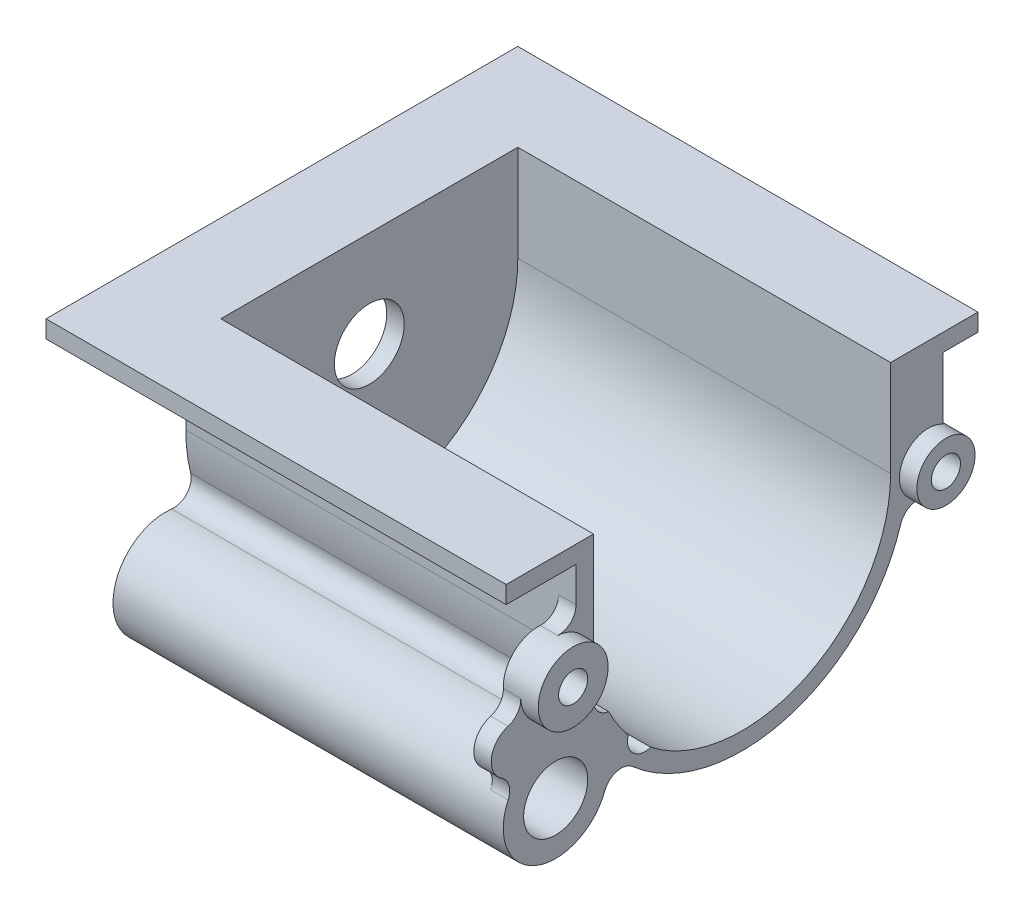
from build123d import *
from build123d.topology import SkipClean

# Parameters (mm, degrees)
EXTRUDE1_DEPTH            = 67
SHELL1_T                  = -3
EXTRUDE2_DEPTH            = 3
EXTRUDE3_START            = -3
EXTRUDE3_DEPTH            = 3
EXTRUDE4_START            = -3
EXTRUDE4_DEPTH            = 3
FILLET1_R                 = 3
SKETCH5_R                 = 5
SKETCH5_R_2               = 6
EXTRUDE5_DEPTH            = 3
EXTRUDE6_START            = 64
EXTRUDE6_DEPTH            = 64
SKETCH7_R                 = 3
CUT_EXTRUDE1_DEPTH        = 64
M5_0_5_DIAMETER_HOLE1_D   = 5
M11_0_11_DIAMETER_HOLE1_D = 11
M12_0_12_DIAMETER_HOLE1_D = 12


with BuildPart() as part:
    # Sketch1 → Extrude1 (new body)
    with BuildSketch(Plane(origin=(0, 0, 0), x_dir=(0, 0, -1), z_dir=(1, 0, 0))):
        with BuildLine():
            Line((28.5, 0), (28.5, 16.5))
            Line((28.5, 16.5), (-28.5, 16.5))
            Line((-28.5, 16.5), (-28.5, 0))
            ThreePointArc((-28.5, 0), (0, -28.5), (28.5, 0))
        make_face()
    extrude(amount=EXTRUDE1_DEPTH)

    # Shell1
    shell1_openings = [part.faces().sort_by_distance(p)[0] for p in [
        (67, -3.46223453, 0),
        (33.5, 16.5, 0),
    ]]
    offset(amount=SHELL1_T, openings=shell1_openings, kind=Kind.INTERSECTION)

    # Sketch2 → Extrude2 (add)
    with BuildSketch(Plane(origin=(0, 16.5, 0), x_dir=(-1, 0, 0), z_dir=(0, 1, 0))):
        Polygon((-3, -25.5), (-67, -25.5), (-67, -28.5), (0, -28.5), (0, 28.5), (-67, 28.5), (-67, 25.5), (-3, 25.5), align=None)
        Polygon((0, -28.5), (-67, -28.5), (-67, -40.5), (12, -40.5), (12, 40.5), (-67, 40.5), (-67, 28.5), (0, 28.5), align=None)
    extrude(amount=-EXTRUDE2_DEPTH)

    # Sketch3 → Extrude3 (add)
    with BuildSketch(Plane(origin=(67, 0, 0), x_dir=(0, 0, -1), z_dir=(1, 0, 0)).offset(EXTRUDE3_START)):
        with BuildLine():
            Line((-28.5, 3.373397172), (-28.5, 0))
            ThreePointArc((-28.5, 0), (-27.356467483, -7.992101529), (-24.017636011, -15.342853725))
            ThreePointArc((-24.017636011, -15.342853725), (-31.795713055, -28.497681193), (-40.162812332, -15.709420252))
            ThreePointArc((-40.162812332, -15.709420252), (-39.999742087, -13.619758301), (-41.244477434, -11.933367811))
            ThreePointArc((-41.244477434, -11.933367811), (-43.014421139, -7.989270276), (-40.164027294, -4.739060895))
            ThreePointArc((-40.164027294, -4.739060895), (-38.561207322, -3.612719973), (-37.995308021, -1.737237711))
            ThreePointArc((-37.995308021, -1.737237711), (-34.843639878, 3.783342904), (-28.5, 3.373397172))
        make_face()
    extrude(amount=EXTRUDE3_DEPTH)

    # Sketch4 → Extrude4 (add)
    with BuildSketch(Plane(origin=(67, 0, 0), x_dir=(0, 0, -1), z_dir=(1, 0, 0)).offset(EXTRUDE4_START)):
        with BuildLine():
            Line((34.5, 2.830127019), (34.5, 13.5))
            Line((34.5, 13.5), (28.5, 13.5))
            Line((28.5, 13.5), (28.5, 0))
            ThreePointArc((28.5, 0), (28.404318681, -2.333383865), (28.117917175, -4.651100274))
            ThreePointArc((28.117917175, -4.651100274), (35.803909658, -4.745037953), (34.5, 2.830127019))
        make_face()
    extrude(amount=EXTRUDE4_DEPTH)

    # Fillet1
    fillet1_edges = [part.edges().sort_by_distance(p)[0] for p in [
        (65.5, 3.373397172, 28.5),
        (65.5, -15.342853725, 24.017636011),
        (65.5, -4.651100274, -28.117917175),
    ]]
    fillet(fillet1_edges, radius=FILLET1_R)

    # Sketch5 → Extrude5 (add)
    with SkipClean():  # the faces are left unmerged after this step: merging them gives an invalid solid
        with BuildSketch(Plane(origin=(67, 0, 0), x_dir=(0, 0, -1), z_dir=(1, 0, 0))):
            with Locations((32, -1.5)):
                Circle(SKETCH5_R)
            with Locations((-32, -1.5)):
                Circle(SKETCH5_R_2)
        extrude(amount=EXTRUDE5_DEPTH)

    # Sketch6 → Extrude6 (add)
    with BuildSketch(Plane.ZY.offset(-64).offset(EXTRUDE6_START)):
        with BuildLine():
            ThreePointArc((23.567577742, -22.645513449), (21.490755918, -20.785192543), (18.779935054, -21.437444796))
            ThreePointArc((18.779935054, -21.437444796), (24.337312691, -14.830549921), (27.661395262, -6.862740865))
            ThreePointArc((27.661395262, -6.862740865), (28.324439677, -9.570942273), (30.929840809, -10.56385098))
            ThreePointArc((30.929840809, -10.56385098), (39.685467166, -24.183331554), (23.567577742, -22.645513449))
        make_face()
    extrude(amount=-EXTRUDE6_DEPTH)

    # Sketch7 → Cut-Extrude1 (cut)
    with BuildSketch(Plane(origin=(67, 0, 0), x_dir=(0, 0, -1), z_dir=(1, 0, 0))):
        with Locations((-22.552622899, -8.20848344)):
            Circle(SKETCH7_R)
        with Locations((-16.671800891, -17.264155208)):
            Circle(SKETCH7_R)
    extrude(amount=-CUT_EXTRUDE1_DEPTH, mode=Mode.SUBTRACT)

    # M5.0 _5_ Diameter Hole1 (through all)
    with Locations(Plane(origin=(70, 0, 0), x_dir=(0, 0, -1), z_dir=(1, 0, 0))):
        with Locations((-32, -1.5), (32, -1.5)):
            Hole(M5_0_5_DIAMETER_HOLE1_D / 2)

    # M11.0 _11_ Diameter Hole1 (through all)
    with Locations(Plane(origin=(67, 0, 0), x_dir=(0, 0, -1), z_dir=(1, 0, 0))):
        with Locations((-32, -19.5)):
            Hole(M11_0_11_DIAMETER_HOLE1_D / 2)

    # M12.0 _12_ Diameter Hole1 (through all)
    with Locations(Plane(origin=(3, 0, 0), x_dir=(0, 0, -1), z_dir=(1, 0, 0))):
        with Locations((0, 0)):
            Hole(M12_0_12_DIAMETER_HOLE1_D / 2)


solid = part.part
